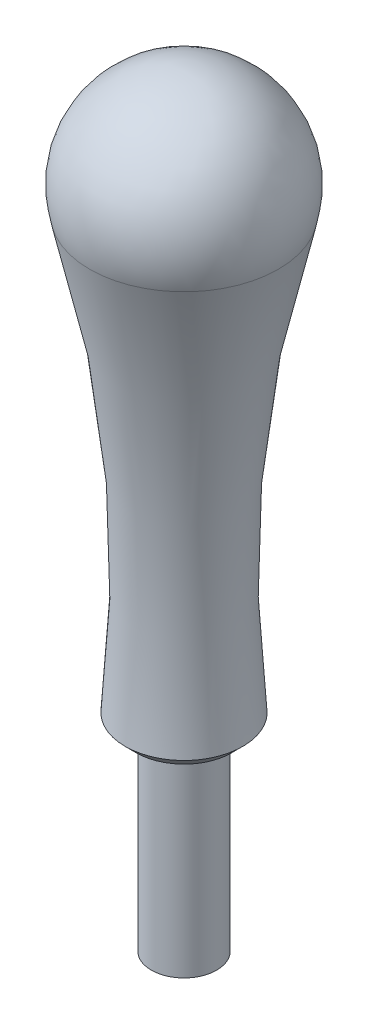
ISO-10303-21;
HEADER;
FILE_DESCRIPTION(('STEP AP214'),'2;1');
FILE_NAME('part.step','',(''),(''),'','','');
FILE_SCHEMA(('AUTOMOTIVE_DESIGN { 1 0 10303 214 1 1 1 1 }'));
ENDSEC;
DATA;
#1=APPLICATION_CONTEXT('core data for automotive mechanical design processes');
#2=APPLICATION_PROTOCOL_DEFINITION('international standard','automotive_design',2000,#1);
#3=PRODUCT_CONTEXT('',#1,'mechanical');
#4=PRODUCT('Part','Part','',(#3));
#5=PRODUCT_RELATED_PRODUCT_CATEGORY('part','',(#4));
#6=PRODUCT_DEFINITION_FORMATION('','',#4);
#7=PRODUCT_DEFINITION_CONTEXT('part definition',#1,'design');
#8=PRODUCT_DEFINITION('design','',#6,#7);
#9=PRODUCT_DEFINITION_SHAPE('','',#8);
#10=(LENGTH_UNIT() NAMED_UNIT(*) SI_UNIT(.MILLI.,.METRE.));
#11=(NAMED_UNIT(*) PLANE_ANGLE_UNIT() SI_UNIT($,.RADIAN.));
#12=(NAMED_UNIT(*) SI_UNIT($,.STERADIAN.) SOLID_ANGLE_UNIT());
#13=UNCERTAINTY_MEASURE_WITH_UNIT(LENGTH_MEASURE(1.E-05),#10,'distance_accuracy_value','');
#14=(GEOMETRIC_REPRESENTATION_CONTEXT(3) GLOBAL_UNCERTAINTY_ASSIGNED_CONTEXT((#13)) GLOBAL_UNIT_ASSIGNED_CONTEXT((#10,
#11,#12)) REPRESENTATION_CONTEXT('',''));
#15=CARTESIAN_POINT('',(0.,0.,0.));
#16=DIRECTION('',(0.,0.,1.));
#17=DIRECTION('',(1.,0.,0.));
#18=AXIS2_PLACEMENT_3D('',#15,#16,#17);
#19=CARTESIAN_POINT('',(0.,0.,0.));
#20=DIRECTION('',(0.,-1.,0.));
#21=DIRECTION('',(0.,0.,-1.));
#22=AXIS2_PLACEMENT_3D('',#19,#20,#21);
#23=PLANE('',#22);
#24=CARTESIAN_POINT('',(0.,0.,0.));
#25=DIRECTION('',(0.,1.,0.));
#26=DIRECTION('',(0.,0.,1.));
#27=AXIS2_PLACEMENT_3D('',#24,#25,#26);
#28=CIRCLE('',#27,5.);
#29=CARTESIAN_POINT('',(0.,0.,5.));
#30=VERTEX_POINT('',#29);
#31=EDGE_CURVE('E10',#30,#30,#28,.T.);
#32=ORIENTED_EDGE('',*,*,#31,.F.);
#33=EDGE_LOOP('',(#32));
#34=FACE_BOUND('',#33,.T.);
#35=ADVANCED_FACE('F30',(#34),#23,.T.);
#36=CARTESIAN_POINT('',(0.,0.,0.));
#37=DIRECTION('',(0.,1.,0.));
#38=DIRECTION('',(0.,0.,1.));
#39=AXIS2_PLACEMENT_3D('',#36,#37,#38);
#40=CYLINDRICAL_SURFACE('',#39,5.);
#41=ORIENTED_EDGE('',*,*,#31,.T.);
#42=EDGE_LOOP('',(#41));
#43=FACE_BOUND('',#42,.T.);
#44=CARTESIAN_POINT('',(0.,30.,0.));
#45=DIRECTION('',(0.,1.,0.));
#46=DIRECTION('',(0.,0.,1.));
#47=AXIS2_PLACEMENT_3D('',#44,#45,#46);
#48=CIRCLE('',#47,5.);
#49=CARTESIAN_POINT('',(0.,30.,5.));
#50=VERTEX_POINT('',#49);
#51=EDGE_CURVE('E36',#50,#50,#48,.T.);
#52=ORIENTED_EDGE('',*,*,#51,.F.);
#53=EDGE_LOOP('',(#52));
#54=FACE_BOUND('',#53,.T.);
#55=ADVANCED_FACE('F69',(#43,#54),#40,.T.);
#56=CARTESIAN_POINT('',(-7.34314575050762,30.,0.));
#57=DIRECTION('',(0.,-1.,0.));
#58=DIRECTION('',(0.,0.,-1.));
#59=AXIS2_PLACEMENT_3D('',#56,#57,#58);
#60=PLANE('',#59);
#61=ORIENTED_EDGE('',*,*,#51,.T.);
#62=EDGE_LOOP('',(#61));
#63=FACE_BOUND('',#62,.T.);
#64=CARTESIAN_POINT('',(0.,30.,0.));
#65=DIRECTION('',(0.,1.,0.));
#66=DIRECTION('',(0.,0.,1.));
#67=AXIS2_PLACEMENT_3D('',#64,#65,#66);
#68=CIRCLE('',#67,7.34314575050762);
#69=CARTESIAN_POINT('',(0.,30.,7.34314575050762));
#70=VERTEX_POINT('',#69);
#71=EDGE_CURVE('E40',#70,#70,#68,.T.);
#72=ORIENTED_EDGE('',*,*,#71,.F.);
#73=EDGE_LOOP('',(#72));
#74=FACE_BOUND('',#73,.T.);
#75=ADVANCED_FACE('F65',(#63,#74),#60,.T.);
#76=CARTESIAN_POINT('',(0.,31.6568542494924,0.));
#77=DIRECTION('',(0.,1.,0.));
#78=DIRECTION('',(0.,0.,1.));
#79=AXIS2_PLACEMENT_3D('',#76,#77,#78);
#80=CONICAL_SURFACE('',#79,8.99999999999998,0.785398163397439);
#81=ORIENTED_EDGE('',*,*,#71,.T.);
#82=EDGE_LOOP('',(#81));
#83=FACE_BOUND('',#82,.T.);
#84=CARTESIAN_POINT('',(0.,31.6568542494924,0.));
#85=DIRECTION('',(0.,1.,0.));
#86=DIRECTION('',(0.,0.,1.));
#87=AXIS2_PLACEMENT_3D('',#84,#85,#86);
#88=CIRCLE('',#87,8.99999999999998);
#89=CARTESIAN_POINT('',(0.,31.6568542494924,8.99999999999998));
#90=VERTEX_POINT('',#89);
#91=EDGE_CURVE('E44',#90,#90,#88,.T.);
#92=ORIENTED_EDGE('',*,*,#91,.F.);
#93=EDGE_LOOP('',(#92));
#94=FACE_BOUND('',#93,.T.);
#95=ADVANCED_FACE('F57',(#83,#94),#80,.T.);
#96=CARTESIAN_POINT('',(0.,50.4003467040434,0.));
#97=DIRECTION('',(0.,1.,0.));
#98=DIRECTION('',(0.,0.,1.));
#99=AXIS2_PLACEMENT_3D('',#96,#97,#98);
#100=TOROIDAL_SURFACE('',#99,184.159254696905,176.159254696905);
#101=ORIENTED_EDGE('',*,*,#91,.T.);
#102=EDGE_LOOP('',(#101));
#103=FACE_BOUND('',#102,.T.);
#104=CARTESIAN_POINT('',(0.,97.6348276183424,0.));
#105=DIRECTION('',(0.,1.,0.));
#106=DIRECTION('',(0.,0.,1.));
#107=AXIS2_PLACEMENT_3D('',#104,#105,#106);
#108=CIRCLE('',#107,14.4507197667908);
#109=CARTESIAN_POINT('',(0.,97.6348276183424,14.4507197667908));
#110=VERTEX_POINT('',#109);
#111=EDGE_CURVE('E49',#110,#110,#108,.T.);
#112=ORIENTED_EDGE('',*,*,#111,.F.);
#113=EDGE_LOOP('',(#112));
#114=FACE_BOUND('',#113,.T.);
#115=ADVANCED_FACE('F55',(#103,#114),#100,.F.);
#116=CARTESIAN_POINT('',(0.,101.656854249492,0.));
#117=DIRECTION('',(0.,1.,0.));
#118=DIRECTION('',(1.,0.,0.));
#119=AXIS2_PLACEMENT_3D('',#116,#117,#118);
#120=SPHERICAL_SURFACE('',#119,15.);
#121=ORIENTED_EDGE('',*,*,#111,.T.);
#122=EDGE_LOOP('',(#121));
#123=FACE_BOUND('',#122,.T.);
#124=ADVANCED_FACE('F53',(#123),#120,.T.);
#125=CLOSED_SHELL('',(#35,#55,#75,#95,#115,#124));
#126=MANIFOLD_SOLID_BREP('B2',#125);
#127=ADVANCED_BREP_SHAPE_REPRESENTATION('',(#18,#126),#14);
#128=SHAPE_DEFINITION_REPRESENTATION(#9,#127);
ENDSEC;
END-ISO-10303-21;
